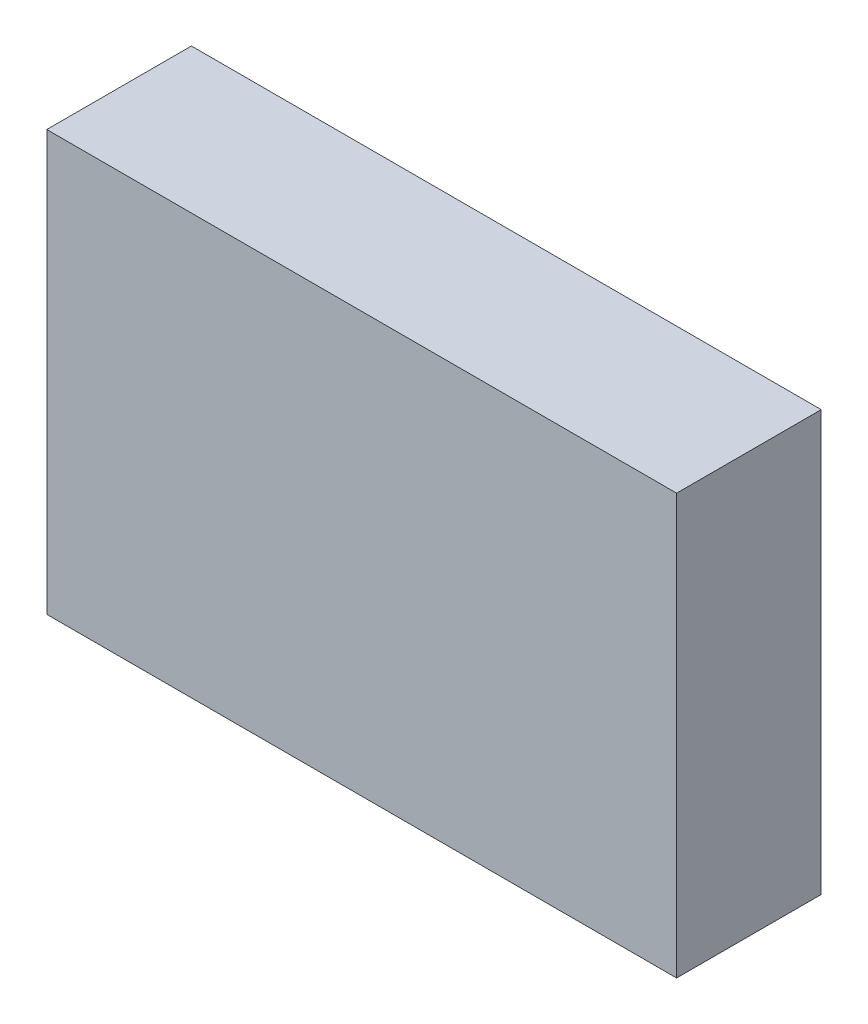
from build123d import *

# Parameters (mm, degrees)
GENERAL_W           = 7.62
GENERAL_H           = 5.08
BOSS_EXTRUDE1_DEPTH = 1.75


with BuildPart() as part:
    # GENERAL → Boss-Extrude1 (new body)
    with BuildSketch(Plane.XY):
        Rectangle(GENERAL_W, GENERAL_H)
    extrude(amount=BOSS_EXTRUDE1_DEPTH)


solid = part.part
